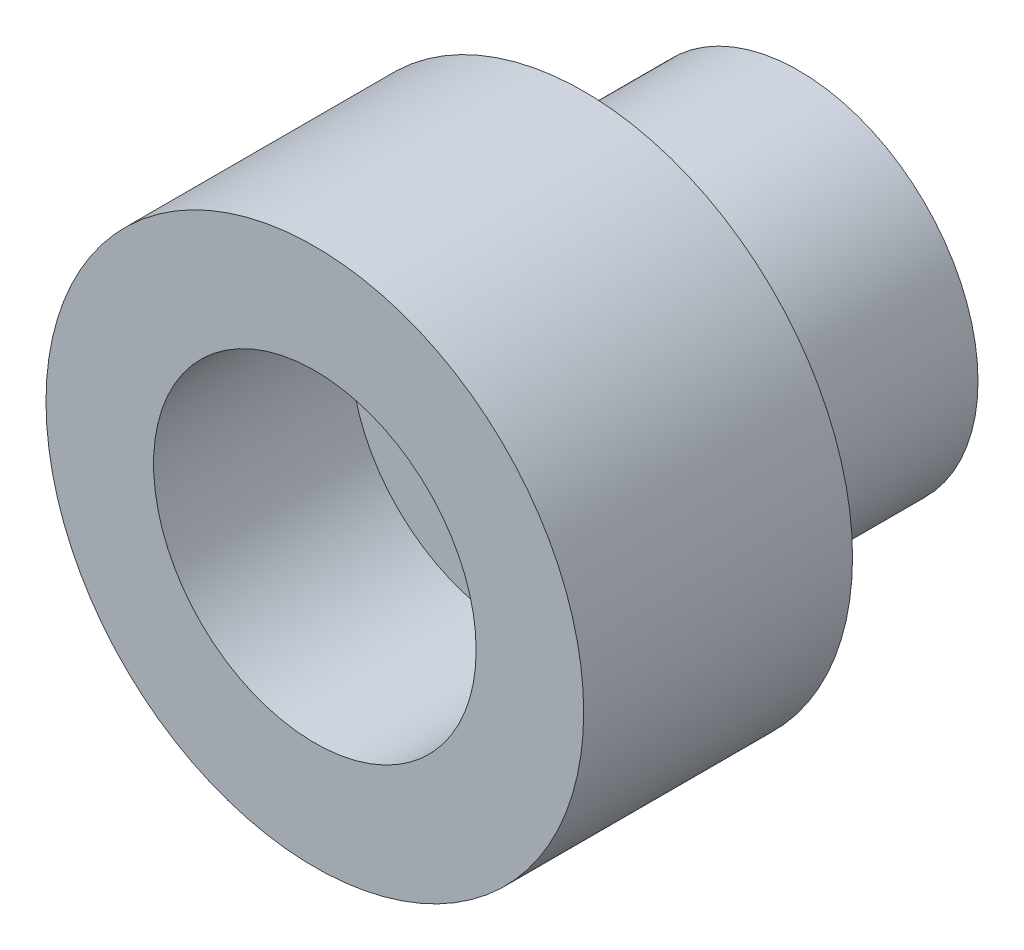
ISO-10303-21;
HEADER;
FILE_DESCRIPTION(('STEP AP214'),'2;1');
FILE_NAME('part.step','',(''),(''),'','','');
FILE_SCHEMA(('AUTOMOTIVE_DESIGN { 1 0 10303 214 1 1 1 1 }'));
ENDSEC;
DATA;
#1=APPLICATION_CONTEXT('core data for automotive mechanical design processes');
#2=APPLICATION_PROTOCOL_DEFINITION('international standard','automotive_design',2000,#1);
#3=PRODUCT_CONTEXT('',#1,'mechanical');
#4=PRODUCT('Part','Part','',(#3));
#5=PRODUCT_RELATED_PRODUCT_CATEGORY('part','',(#4));
#6=PRODUCT_DEFINITION_FORMATION('','',#4);
#7=PRODUCT_DEFINITION_CONTEXT('part definition',#1,'design');
#8=PRODUCT_DEFINITION('design','',#6,#7);
#9=PRODUCT_DEFINITION_SHAPE('','',#8);
#10=(LENGTH_UNIT() NAMED_UNIT(*) SI_UNIT(.MILLI.,.METRE.));
#11=(NAMED_UNIT(*) PLANE_ANGLE_UNIT() SI_UNIT($,.RADIAN.));
#12=(NAMED_UNIT(*) SI_UNIT($,.STERADIAN.) SOLID_ANGLE_UNIT());
#13=UNCERTAINTY_MEASURE_WITH_UNIT(LENGTH_MEASURE(1.E-05),#10,'distance_accuracy_value','');
#14=(GEOMETRIC_REPRESENTATION_CONTEXT(3) GLOBAL_UNCERTAINTY_ASSIGNED_CONTEXT((#13)) GLOBAL_UNIT_ASSIGNED_CONTEXT((#10,
#11,#12)) REPRESENTATION_CONTEXT('',''));
#15=CARTESIAN_POINT('',(0.,0.,0.));
#16=DIRECTION('',(0.,0.,1.));
#17=DIRECTION('',(1.,0.,0.));
#18=AXIS2_PLACEMENT_3D('',#15,#16,#17);
#19=CARTESIAN_POINT('',(15.,0.,15.));
#20=DIRECTION('',(0.,0.,-1.));
#21=DIRECTION('',(-1.,0.,0.));
#22=AXIS2_PLACEMENT_3D('',#19,#20,#21);
#23=PLANE('',#22);
#24=CARTESIAN_POINT('',(0.,0.,15.));
#25=DIRECTION('',(0.,0.,1.));
#26=DIRECTION('',(1.,0.,0.));
#27=AXIS2_PLACEMENT_3D('',#24,#25,#26);
#28=CIRCLE('',#27,9.);
#29=CARTESIAN_POINT('',(9.,0.,15.));
#30=VERTEX_POINT('',#29);
#31=EDGE_CURVE('E8',#30,#30,#28,.T.);
#32=ORIENTED_EDGE('',*,*,#31,.F.);
#33=EDGE_LOOP('',(#32));
#34=FACE_BOUND('',#33,.T.);
#35=CARTESIAN_POINT('',(0.,0.,15.));
#36=DIRECTION('',(0.,0.,1.));
#37=DIRECTION('',(1.,0.,0.));
#38=AXIS2_PLACEMENT_3D('',#35,#36,#37);
#39=CIRCLE('',#38,15.);
#40=CARTESIAN_POINT('',(15.,0.,15.));
#41=VERTEX_POINT('',#40);
#42=EDGE_CURVE('E40',#41,#41,#39,.T.);
#43=ORIENTED_EDGE('',*,*,#42,.T.);
#44=EDGE_LOOP('',(#43));
#45=FACE_BOUND('',#44,.T.);
#46=ADVANCED_FACE('F12',(#34,#45),#23,.F.);
#47=CARTESIAN_POINT('',(0.,0.,18.));
#48=DIRECTION('',(0.,0.,1.));
#49=DIRECTION('',(1.,0.,0.));
#50=AXIS2_PLACEMENT_3D('',#47,#48,#49);
#51=CYLINDRICAL_SURFACE('',#50,9.);
#52=CARTESIAN_POINT('',(0.,0.,4.));
#53=DIRECTION('',(0.,0.,1.));
#54=DIRECTION('',(1.,0.,0.));
#55=AXIS2_PLACEMENT_3D('',#52,#53,#54);
#56=CIRCLE('',#55,9.);
#57=CARTESIAN_POINT('',(9.,0.,4.));
#58=VERTEX_POINT('',#57);
#59=EDGE_CURVE('E18',#58,#58,#56,.T.);
#60=ORIENTED_EDGE('',*,*,#59,.F.);
#61=EDGE_LOOP('',(#60));
#62=FACE_BOUND('',#61,.T.);
#63=ORIENTED_EDGE('',*,*,#31,.T.);
#64=EDGE_LOOP('',(#63));
#65=FACE_BOUND('',#64,.T.);
#66=ADVANCED_FACE('F77',(#62,#65),#51,.F.);
#67=CARTESIAN_POINT('',(9.,0.,4.));
#68=DIRECTION('',(0.,0.,-1.));
#69=DIRECTION('',(-1.,0.,0.));
#70=AXIS2_PLACEMENT_3D('',#67,#68,#69);
#71=PLANE('',#70);
#72=CARTESIAN_POINT('',(0.,0.,4.));
#73=DIRECTION('',(0.,0.,1.));
#74=DIRECTION('',(1.,0.,0.));
#75=AXIS2_PLACEMENT_3D('',#72,#73,#74);
#76=CIRCLE('',#75,5.5);
#77=CARTESIAN_POINT('',(5.5,0.,4.));
#78=VERTEX_POINT('',#77);
#79=EDGE_CURVE('E22',#78,#78,#76,.T.);
#80=ORIENTED_EDGE('',*,*,#79,.F.);
#81=EDGE_LOOP('',(#80));
#82=FACE_BOUND('',#81,.T.);
#83=ORIENTED_EDGE('',*,*,#59,.T.);
#84=EDGE_LOOP('',(#83));
#85=FACE_BOUND('',#84,.T.);
#86=ADVANCED_FACE('F72',(#82,#85),#71,.F.);
#87=CARTESIAN_POINT('',(0.,0.,18.));
#88=DIRECTION('',(0.,0.,1.));
#89=DIRECTION('',(1.,0.,0.));
#90=AXIS2_PLACEMENT_3D('',#87,#88,#89);
#91=CYLINDRICAL_SURFACE('',#90,5.5);
#92=CARTESIAN_POINT('',(0.,0.,-12.));
#93=DIRECTION('',(0.,0.,1.));
#94=DIRECTION('',(1.,0.,0.));
#95=AXIS2_PLACEMENT_3D('',#92,#93,#94);
#96=CIRCLE('',#95,5.5);
#97=CARTESIAN_POINT('',(5.5,0.,-12.));
#98=VERTEX_POINT('',#97);
#99=EDGE_CURVE('E26',#98,#98,#96,.T.);
#100=ORIENTED_EDGE('',*,*,#99,.F.);
#101=EDGE_LOOP('',(#100));
#102=FACE_BOUND('',#101,.T.);
#103=ORIENTED_EDGE('',*,*,#79,.T.);
#104=EDGE_LOOP('',(#103));
#105=FACE_BOUND('',#104,.T.);
#106=ADVANCED_FACE('F66',(#102,#105),#91,.F.);
#107=CARTESIAN_POINT('',(5.5,0.,-12.));
#108=DIRECTION('',(0.,0.,1.));
#109=DIRECTION('',(1.,0.,0.));
#110=AXIS2_PLACEMENT_3D('',#107,#108,#109);
#111=PLANE('',#110);
#112=CARTESIAN_POINT('',(0.,0.,-12.));
#113=DIRECTION('',(0.,0.,1.));
#114=DIRECTION('',(1.,0.,0.));
#115=AXIS2_PLACEMENT_3D('',#112,#113,#114);
#116=CIRCLE('',#115,10.);
#117=CARTESIAN_POINT('',(10.,0.,-12.));
#118=VERTEX_POINT('',#117);
#119=EDGE_CURVE('E31',#118,#118,#116,.T.);
#120=ORIENTED_EDGE('',*,*,#119,.F.);
#121=EDGE_LOOP('',(#120));
#122=FACE_BOUND('',#121,.T.);
#123=ORIENTED_EDGE('',*,*,#99,.T.);
#124=EDGE_LOOP('',(#123));
#125=FACE_BOUND('',#124,.T.);
#126=ADVANCED_FACE('F60',(#122,#125),#111,.F.);
#127=CARTESIAN_POINT('',(0.,0.,18.));
#128=DIRECTION('',(0.,0.,1.));
#129=DIRECTION('',(1.,0.,0.));
#130=AXIS2_PLACEMENT_3D('',#127,#128,#129);
#131=CYLINDRICAL_SURFACE('',#130,10.);
#132=CARTESIAN_POINT('',(0.,0.,0.));
#133=DIRECTION('',(0.,0.,1.));
#134=DIRECTION('',(1.,0.,0.));
#135=AXIS2_PLACEMENT_3D('',#132,#133,#134);
#136=CIRCLE('',#135,10.);
#137=CARTESIAN_POINT('',(10.,0.,0.));
#138=VERTEX_POINT('',#137);
#139=EDGE_CURVE('E34',#138,#138,#136,.T.);
#140=ORIENTED_EDGE('',*,*,#139,.F.);
#141=EDGE_LOOP('',(#140));
#142=FACE_BOUND('',#141,.T.);
#143=ORIENTED_EDGE('',*,*,#119,.T.);
#144=EDGE_LOOP('',(#143));
#145=FACE_BOUND('',#144,.T.);
#146=ADVANCED_FACE('F54',(#142,#145),#131,.T.);
#147=CARTESIAN_POINT('',(10.,0.,0.));
#148=DIRECTION('',(0.,0.,1.));
#149=DIRECTION('',(1.,0.,0.));
#150=AXIS2_PLACEMENT_3D('',#147,#148,#149);
#151=PLANE('',#150);
#152=CARTESIAN_POINT('',(0.,0.,0.));
#153=DIRECTION('',(0.,0.,1.));
#154=DIRECTION('',(1.,0.,0.));
#155=AXIS2_PLACEMENT_3D('',#152,#153,#154);
#156=CIRCLE('',#155,15.);
#157=CARTESIAN_POINT('',(15.,0.,0.));
#158=VERTEX_POINT('',#157);
#159=EDGE_CURVE('E37',#158,#158,#156,.T.);
#160=ORIENTED_EDGE('',*,*,#159,.F.);
#161=EDGE_LOOP('',(#160));
#162=FACE_BOUND('',#161,.T.);
#163=ORIENTED_EDGE('',*,*,#139,.T.);
#164=EDGE_LOOP('',(#163));
#165=FACE_BOUND('',#164,.T.);
#166=ADVANCED_FACE('F48',(#162,#165),#151,.F.);
#167=CARTESIAN_POINT('',(0.,0.,18.));
#168=DIRECTION('',(0.,0.,1.));
#169=DIRECTION('',(1.,0.,0.));
#170=AXIS2_PLACEMENT_3D('',#167,#168,#169);
#171=CYLINDRICAL_SURFACE('',#170,15.);
#172=ORIENTED_EDGE('',*,*,#42,.F.);
#173=EDGE_LOOP('',(#172));
#174=FACE_BOUND('',#173,.T.);
#175=ORIENTED_EDGE('',*,*,#159,.T.);
#176=EDGE_LOOP('',(#175));
#177=FACE_BOUND('',#176,.T.);
#178=ADVANCED_FACE('F45',(#174,#177),#171,.T.);
#179=CLOSED_SHELL('',(#46,#66,#86,#106,#126,#146,#166,#178));
#180=MANIFOLD_SOLID_BREP('B1',#179);
#181=ADVANCED_BREP_SHAPE_REPRESENTATION('',(#18,#180),#14);
#182=SHAPE_DEFINITION_REPRESENTATION(#9,#181);
ENDSEC;
END-ISO-10303-21;
